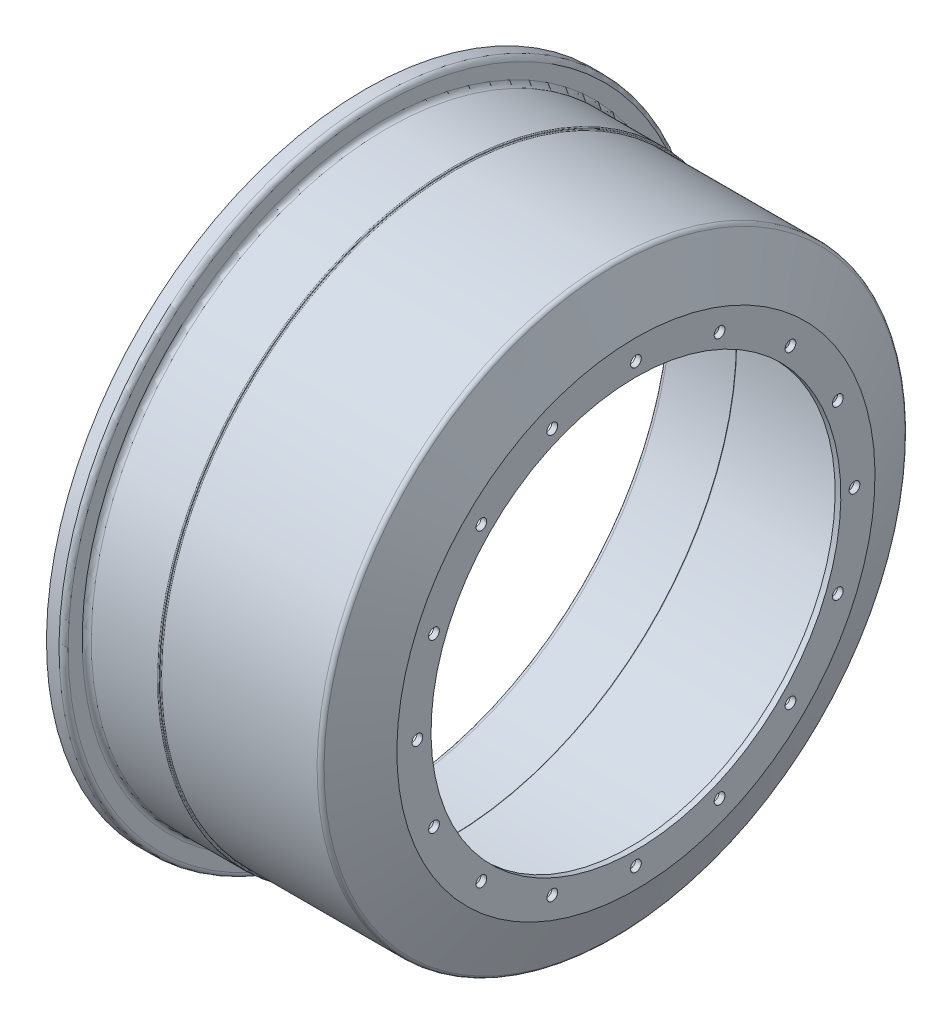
ISO-10303-21;
HEADER;
FILE_DESCRIPTION(('STEP AP214'),'2;1');
FILE_NAME('part.step','',(''),(''),'','','');
FILE_SCHEMA(('AUTOMOTIVE_DESIGN { 1 0 10303 214 1 1 1 1 }'));
ENDSEC;
DATA;
#1=APPLICATION_CONTEXT('core data for automotive mechanical design processes');
#2=APPLICATION_PROTOCOL_DEFINITION('international standard','automotive_design',2000,#1);
#3=PRODUCT_CONTEXT('',#1,'mechanical');
#4=PRODUCT('Part','Part','',(#3));
#5=PRODUCT_RELATED_PRODUCT_CATEGORY('part','',(#4));
#6=PRODUCT_DEFINITION_FORMATION('','',#4);
#7=PRODUCT_DEFINITION_CONTEXT('part definition',#1,'design');
#8=PRODUCT_DEFINITION('design','',#6,#7);
#9=PRODUCT_DEFINITION_SHAPE('','',#8);
#10=(LENGTH_UNIT() NAMED_UNIT(*) SI_UNIT(.MILLI.,.METRE.));
#11=(NAMED_UNIT(*) PLANE_ANGLE_UNIT() SI_UNIT($,.RADIAN.));
#12=(NAMED_UNIT(*) SI_UNIT($,.STERADIAN.) SOLID_ANGLE_UNIT());
#13=UNCERTAINTY_MEASURE_WITH_UNIT(LENGTH_MEASURE(1.E-05),#10,'distance_accuracy_value','');
#14=(GEOMETRIC_REPRESENTATION_CONTEXT(3) GLOBAL_UNCERTAINTY_ASSIGNED_CONTEXT((#13)) GLOBAL_UNIT_ASSIGNED_CONTEXT((#10,
#11,#12)) REPRESENTATION_CONTEXT('',''));
#15=CARTESIAN_POINT('',(0.,0.,0.));
#16=DIRECTION('',(0.,0.,1.));
#17=DIRECTION('',(1.,0.,0.));
#18=AXIS2_PLACEMENT_3D('',#15,#16,#17);
#19=CARTESIAN_POINT('',(0.,133.35,0.));
#20=DIRECTION('',(1.,0.,0.));
#21=DIRECTION('',(0.,1.,0.));
#22=AXIS2_PLACEMENT_3D('',#19,#20,#21);
#23=PLANE('',#22);
#24=CARTESIAN_POINT('',(0.,86.2104587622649,-86.2104587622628));
#25=DIRECTION('',(-1.,0.,0.));
#26=DIRECTION('',(0.,0.,1.));
#27=AXIS2_PLACEMENT_3D('',#24,#25,#26);
#28=CIRCLE('',#27,3.);
#29=CARTESIAN_POINT('',(0.,86.2104587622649,-83.2104587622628));
#30=VERTEX_POINT('',#29);
#31=EDGE_CURVE('E208',#30,#30,#28,.T.);
#32=ORIENTED_EDGE('',*,*,#31,.T.);
#33=EDGE_LOOP('',(#32));
#34=FACE_BOUND('',#33,.T.);
#35=CARTESIAN_POINT('',(0.,1.27704495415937E-12,-121.92));
#36=DIRECTION('',(-1.,0.,0.));
#37=DIRECTION('',(0.,0.,1.));
#38=AXIS2_PLACEMENT_3D('',#35,#36,#37);
#39=CIRCLE('',#38,3.);
#40=CARTESIAN_POINT('',(0.,1.27704495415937E-12,-118.92));
#41=VERTEX_POINT('',#40);
#42=EDGE_CURVE('E196',#41,#41,#39,.T.);
#43=ORIENTED_EDGE('',*,*,#42,.T.);
#44=EDGE_LOOP('',(#43));
#45=FACE_BOUND('',#44,.T.);
#46=CARTESIAN_POINT('',(0.,-86.2104587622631,-86.2104587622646));
#47=DIRECTION('',(-1.,0.,0.));
#48=DIRECTION('',(0.,0.,1.));
#49=AXIS2_PLACEMENT_3D('',#46,#47,#48);
#50=CIRCLE('',#49,3.);
#51=CARTESIAN_POINT('',(0.,-86.2104587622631,-83.2104587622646));
#52=VERTEX_POINT('',#51);
#53=EDGE_CURVE('E184',#52,#52,#50,.T.);
#54=ORIENTED_EDGE('',*,*,#53,.T.);
#55=EDGE_LOOP('',(#54));
#56=FACE_BOUND('',#55,.T.);
#57=CARTESIAN_POINT('',(0.,-121.92,-8.51363302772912E-13));
#58=DIRECTION('',(-1.,0.,0.));
#59=DIRECTION('',(0.,0.,1.));
#60=AXIS2_PLACEMENT_3D('',#57,#58,#59);
#61=CIRCLE('',#60,3.);
#62=CARTESIAN_POINT('',(0.,-121.92,2.99999999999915));
#63=VERTEX_POINT('',#62);
#64=EDGE_CURVE('E172',#63,#63,#61,.T.);
#65=ORIENTED_EDGE('',*,*,#64,.T.);
#66=EDGE_LOOP('',(#65));
#67=FACE_BOUND('',#66,.T.);
#68=CARTESIAN_POINT('',(0.,-86.2104587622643,86.2104587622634));
#69=DIRECTION('',(-1.,0.,0.));
#70=DIRECTION('',(0.,0.,1.));
#71=AXIS2_PLACEMENT_3D('',#68,#69,#70);
#72=CIRCLE('',#71,3.);
#73=CARTESIAN_POINT('',(0.,-86.2104587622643,89.2104587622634));
#74=VERTEX_POINT('',#73);
#75=EDGE_CURVE('E160',#74,#74,#72,.T.);
#76=ORIENTED_EDGE('',*,*,#75,.T.);
#77=EDGE_LOOP('',(#76));
#78=FACE_BOUND('',#77,.T.);
#79=CARTESIAN_POINT('',(0.,0.,0.));
#80=DIRECTION('',(1.,0.,0.));
#81=DIRECTION('',(0.,1.,0.));
#82=AXIS2_PLACEMENT_3D('',#79,#80,#81);
#83=CIRCLE('',#82,114.3);
#84=CARTESIAN_POINT('',(0.,114.3,0.));
#85=VERTEX_POINT('',#84);
#86=EDGE_CURVE('E42',#85,#85,#83,.T.);
#87=ORIENTED_EDGE('',*,*,#86,.F.);
#88=EDGE_LOOP('',(#87));
#89=FACE_BOUND('',#88,.T.);
#90=CARTESIAN_POINT('',(0.,0.,0.));
#91=DIRECTION('',(1.,0.,0.));
#92=DIRECTION('',(0.,1.,0.));
#93=AXIS2_PLACEMENT_3D('',#90,#91,#92);
#94=CIRCLE('',#93,133.35);
#95=CARTESIAN_POINT('',(0.,133.35,0.));
#96=VERTEX_POINT('',#95);
#97=EDGE_CURVE('E46',#96,#96,#94,.T.);
#98=ORIENTED_EDGE('',*,*,#97,.T.);
#99=EDGE_LOOP('',(#98));
#100=FACE_BOUND('',#99,.T.);
#101=CARTESIAN_POINT('',(0.,121.92,0.));
#102=DIRECTION('',(-1.,0.,0.));
#103=DIRECTION('',(0.,0.,1.));
#104=AXIS2_PLACEMENT_3D('',#101,#102,#103);
#105=CIRCLE('',#104,3.);
#106=CARTESIAN_POINT('',(0.,121.92,3.));
#107=VERTEX_POINT('',#106);
#108=EDGE_CURVE('E124',#107,#107,#105,.T.);
#109=ORIENTED_EDGE('',*,*,#108,.T.);
#110=EDGE_LOOP('',(#109));
#111=FACE_BOUND('',#110,.T.);
#112=CARTESIAN_POINT('',(0.,112.639392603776,46.6567640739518));
#113=DIRECTION('',(-1.,0.,0.));
#114=DIRECTION('',(0.,0.,1.));
#115=AXIS2_PLACEMENT_3D('',#112,#113,#114);
#116=CIRCLE('',#115,3.);
#117=CARTESIAN_POINT('',(0.,112.639392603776,49.6567640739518));
#118=VERTEX_POINT('',#117);
#119=EDGE_CURVE('E130',#118,#118,#116,.T.);
#120=ORIENTED_EDGE('',*,*,#119,.T.);
#121=EDGE_LOOP('',(#120));
#122=FACE_BOUND('',#121,.T.);
#123=CARTESIAN_POINT('',(0.,86.2104587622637,86.210458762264));
#124=DIRECTION('',(-1.,0.,0.));
#125=DIRECTION('',(0.,0.,1.));
#126=AXIS2_PLACEMENT_3D('',#123,#124,#125);
#127=CIRCLE('',#126,3.);
#128=CARTESIAN_POINT('',(0.,86.2104587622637,89.210458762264));
#129=VERTEX_POINT('',#128);
#130=EDGE_CURVE('E136',#129,#129,#127,.T.);
#131=ORIENTED_EDGE('',*,*,#130,.T.);
#132=EDGE_LOOP('',(#131));
#133=FACE_BOUND('',#132,.T.);
#134=CARTESIAN_POINT('',(0.,46.6567640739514,112.639392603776));
#135=DIRECTION('',(-1.,0.,0.));
#136=DIRECTION('',(0.,0.,1.));
#137=AXIS2_PLACEMENT_3D('',#134,#135,#136);
#138=CIRCLE('',#137,3.);
#139=CARTESIAN_POINT('',(0.,46.6567640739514,115.639392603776));
#140=VERTEX_POINT('',#139);
#141=EDGE_CURVE('E142',#140,#140,#138,.T.);
#142=ORIENTED_EDGE('',*,*,#141,.T.);
#143=EDGE_LOOP('',(#142));
#144=FACE_BOUND('',#143,.T.);
#145=CARTESIAN_POINT('',(0.,-4.25681651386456E-13,121.92));
#146=DIRECTION('',(-1.,0.,0.));
#147=DIRECTION('',(0.,0.,1.));
#148=AXIS2_PLACEMENT_3D('',#145,#146,#147);
#149=CIRCLE('',#148,3.);
#150=CARTESIAN_POINT('',(0.,-4.25681651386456E-13,124.92));
#151=VERTEX_POINT('',#150);
#152=EDGE_CURVE('E148',#151,#151,#149,.T.);
#153=ORIENTED_EDGE('',*,*,#152,.T.);
#154=EDGE_LOOP('',(#153));
#155=FACE_BOUND('',#154,.T.);
#156=CARTESIAN_POINT('',(0.,-46.6567640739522,112.639392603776));
#157=DIRECTION('',(-1.,0.,0.));
#158=DIRECTION('',(0.,0.,1.));
#159=AXIS2_PLACEMENT_3D('',#156,#157,#158);
#160=CIRCLE('',#159,3.);
#161=CARTESIAN_POINT('',(0.,-46.6567640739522,115.639392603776));
#162=VERTEX_POINT('',#161);
#163=EDGE_CURVE('E154',#162,#162,#160,.T.);
#164=ORIENTED_EDGE('',*,*,#163,.T.);
#165=EDGE_LOOP('',(#164));
#166=FACE_BOUND('',#165,.T.);
#167=CARTESIAN_POINT('',(0.,-112.639392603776,46.6567640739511));
#168=DIRECTION('',(-1.,0.,0.));
#169=DIRECTION('',(0.,0.,1.));
#170=AXIS2_PLACEMENT_3D('',#167,#168,#169);
#171=CIRCLE('',#170,3.);
#172=CARTESIAN_POINT('',(0.,-112.639392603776,49.6567640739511));
#173=VERTEX_POINT('',#172);
#174=EDGE_CURVE('E166',#173,#173,#171,.T.);
#175=ORIENTED_EDGE('',*,*,#174,.T.);
#176=EDGE_LOOP('',(#175));
#177=FACE_BOUND('',#176,.T.);
#178=CARTESIAN_POINT('',(0.,-112.639392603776,-46.6567640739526));
#179=DIRECTION('',(-1.,0.,0.));
#180=DIRECTION('',(0.,0.,1.));
#181=AXIS2_PLACEMENT_3D('',#178,#179,#180);
#182=CIRCLE('',#181,3.);
#183=CARTESIAN_POINT('',(0.,-112.639392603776,-43.6567640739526));
#184=VERTEX_POINT('',#183);
#185=EDGE_CURVE('E178',#184,#184,#182,.T.);
#186=ORIENTED_EDGE('',*,*,#185,.T.);
#187=EDGE_LOOP('',(#186));
#188=FACE_BOUND('',#187,.T.);
#189=CARTESIAN_POINT('',(0.,-46.6567640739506,-112.639392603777));
#190=DIRECTION('',(-1.,0.,0.));
#191=DIRECTION('',(0.,0.,1.));
#192=AXIS2_PLACEMENT_3D('',#189,#190,#191);
#193=CIRCLE('',#192,3.);
#194=CARTESIAN_POINT('',(0.,-46.6567640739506,-109.639392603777));
#195=VERTEX_POINT('',#194);
#196=EDGE_CURVE('E190',#195,#195,#193,.T.);
#197=ORIENTED_EDGE('',*,*,#196,.T.);
#198=EDGE_LOOP('',(#197));
#199=FACE_BOUND('',#198,.T.);
#200=CARTESIAN_POINT('',(0.,46.656764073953,-112.639392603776));
#201=DIRECTION('',(-1.,0.,0.));
#202=DIRECTION('',(0.,0.,1.));
#203=AXIS2_PLACEMENT_3D('',#200,#201,#202);
#204=CIRCLE('',#203,3.);
#205=CARTESIAN_POINT('',(0.,46.656764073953,-109.639392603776));
#206=VERTEX_POINT('',#205);
#207=EDGE_CURVE('E202',#206,#206,#204,.T.);
#208=ORIENTED_EDGE('',*,*,#207,.T.);
#209=EDGE_LOOP('',(#208));
#210=FACE_BOUND('',#209,.T.);
#211=CARTESIAN_POINT('',(0.,112.639392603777,-46.6567640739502));
#212=DIRECTION('',(-1.,0.,0.));
#213=DIRECTION('',(0.,0.,1.));
#214=AXIS2_PLACEMENT_3D('',#211,#212,#213);
#215=CIRCLE('',#214,3.);
#216=CARTESIAN_POINT('',(0.,112.639392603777,-43.6567640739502));
#217=VERTEX_POINT('',#216);
#218=EDGE_CURVE('E214',#217,#217,#215,.T.);
#219=ORIENTED_EDGE('',*,*,#218,.T.);
#220=EDGE_LOOP('',(#219));
#221=FACE_BOUND('',#220,.T.);
#222=ADVANCED_FACE('F35',(#34,#45,#56,#67,#78,#89,#100,#111,#122,#133,#144,#155,#166,#177,#188,
#199,#210,#221),#23,.T.);
#223=CARTESIAN_POINT('',(-3.17499999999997,130.175,0.));
#224=DIRECTION('',(-1.,0.,0.));
#225=DIRECTION('',(0.,-1.,0.));
#226=AXIS2_PLACEMENT_3D('',#223,#224,#225);
#227=PLANE('',#226);
#228=CARTESIAN_POINT('',(-3.17499999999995,112.639392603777,-46.6567640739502));
#229=DIRECTION('',(-1.,0.,0.));
#230=DIRECTION('',(0.,0.,1.));
#231=AXIS2_PLACEMENT_3D('',#228,#229,#230);
#232=CIRCLE('',#231,3.);
#233=CARTESIAN_POINT('',(-3.17499999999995,112.639392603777,-43.6567640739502));
#234=VERTEX_POINT('',#233);
#235=EDGE_CURVE('E211',#234,#234,#232,.T.);
#236=ORIENTED_EDGE('',*,*,#235,.F.);
#237=EDGE_LOOP('',(#236));
#238=FACE_BOUND('',#237,.T.);
#239=CARTESIAN_POINT('',(-3.17499999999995,86.2104587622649,-86.2104587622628));
#240=DIRECTION('',(-1.,0.,0.));
#241=DIRECTION('',(0.,0.,1.));
#242=AXIS2_PLACEMENT_3D('',#239,#240,#241);
#243=CIRCLE('',#242,3.);
#244=CARTESIAN_POINT('',(-3.17499999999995,86.2104587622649,-83.2104587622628));
#245=VERTEX_POINT('',#244);
#246=EDGE_CURVE('E205',#245,#245,#243,.T.);
#247=ORIENTED_EDGE('',*,*,#246,.F.);
#248=EDGE_LOOP('',(#247));
#249=FACE_BOUND('',#248,.T.);
#250=CARTESIAN_POINT('',(-3.17499999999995,46.656764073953,-112.639392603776));
#251=DIRECTION('',(-1.,0.,0.));
#252=DIRECTION('',(0.,0.,1.));
#253=AXIS2_PLACEMENT_3D('',#250,#251,#252);
#254=CIRCLE('',#253,3.);
#255=CARTESIAN_POINT('',(-3.17499999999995,46.656764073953,-109.639392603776));
#256=VERTEX_POINT('',#255);
#257=EDGE_CURVE('E199',#256,#256,#254,.T.);
#258=ORIENTED_EDGE('',*,*,#257,.F.);
#259=EDGE_LOOP('',(#258));
#260=FACE_BOUND('',#259,.T.);
#261=CARTESIAN_POINT('',(-3.17499999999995,1.27704495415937E-12,-121.92));
#262=DIRECTION('',(-1.,0.,0.));
#263=DIRECTION('',(0.,0.,1.));
#264=AXIS2_PLACEMENT_3D('',#261,#262,#263);
#265=CIRCLE('',#264,3.);
#266=CARTESIAN_POINT('',(-3.17499999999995,1.27704495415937E-12,-118.92));
#267=VERTEX_POINT('',#266);
#268=EDGE_CURVE('E193',#267,#267,#265,.T.);
#269=ORIENTED_EDGE('',*,*,#268,.F.);
#270=EDGE_LOOP('',(#269));
#271=FACE_BOUND('',#270,.T.);
#272=CARTESIAN_POINT('',(-3.17499999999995,-46.6567640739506,-112.639392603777));
#273=DIRECTION('',(-1.,0.,0.));
#274=DIRECTION('',(0.,0.,1.));
#275=AXIS2_PLACEMENT_3D('',#272,#273,#274);
#276=CIRCLE('',#275,3.);
#277=CARTESIAN_POINT('',(-3.17499999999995,-46.6567640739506,-109.639392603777));
#278=VERTEX_POINT('',#277);
#279=EDGE_CURVE('E187',#278,#278,#276,.T.);
#280=ORIENTED_EDGE('',*,*,#279,.F.);
#281=EDGE_LOOP('',(#280));
#282=FACE_BOUND('',#281,.T.);
#283=CARTESIAN_POINT('',(-3.17499999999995,-86.2104587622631,-86.2104587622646));
#284=DIRECTION('',(-1.,0.,0.));
#285=DIRECTION('',(0.,0.,1.));
#286=AXIS2_PLACEMENT_3D('',#283,#284,#285);
#287=CIRCLE('',#286,3.);
#288=CARTESIAN_POINT('',(-3.17499999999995,-86.2104587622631,-83.2104587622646));
#289=VERTEX_POINT('',#288);
#290=EDGE_CURVE('E181',#289,#289,#287,.T.);
#291=ORIENTED_EDGE('',*,*,#290,.F.);
#292=EDGE_LOOP('',(#291));
#293=FACE_BOUND('',#292,.T.);
#294=CARTESIAN_POINT('',(-3.17499999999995,-112.639392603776,-46.6567640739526));
#295=DIRECTION('',(-1.,0.,0.));
#296=DIRECTION('',(0.,0.,1.));
#297=AXIS2_PLACEMENT_3D('',#294,#295,#296);
#298=CIRCLE('',#297,3.);
#299=CARTESIAN_POINT('',(-3.17499999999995,-112.639392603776,-43.6567640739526));
#300=VERTEX_POINT('',#299);
#301=EDGE_CURVE('E175',#300,#300,#298,.T.);
#302=ORIENTED_EDGE('',*,*,#301,.F.);
#303=EDGE_LOOP('',(#302));
#304=FACE_BOUND('',#303,.T.);
#305=CARTESIAN_POINT('',(-3.17499999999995,-121.92,-8.51363302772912E-13));
#306=DIRECTION('',(-1.,0.,0.));
#307=DIRECTION('',(0.,0.,1.));
#308=AXIS2_PLACEMENT_3D('',#305,#306,#307);
#309=CIRCLE('',#308,3.);
#310=CARTESIAN_POINT('',(-3.17499999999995,-121.92,2.99999999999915));
#311=VERTEX_POINT('',#310);
#312=EDGE_CURVE('E169',#311,#311,#309,.T.);
#313=ORIENTED_EDGE('',*,*,#312,.F.);
#314=EDGE_LOOP('',(#313));
#315=FACE_BOUND('',#314,.T.);
#316=CARTESIAN_POINT('',(-3.17499999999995,-112.639392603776,46.6567640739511));
#317=DIRECTION('',(-1.,0.,0.));
#318=DIRECTION('',(0.,0.,1.));
#319=AXIS2_PLACEMENT_3D('',#316,#317,#318);
#320=CIRCLE('',#319,3.);
#321=CARTESIAN_POINT('',(-3.17499999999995,-112.639392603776,49.6567640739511));
#322=VERTEX_POINT('',#321);
#323=EDGE_CURVE('E163',#322,#322,#320,.T.);
#324=ORIENTED_EDGE('',*,*,#323,.F.);
#325=EDGE_LOOP('',(#324));
#326=FACE_BOUND('',#325,.T.);
#327=CARTESIAN_POINT('',(-3.17499999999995,-86.2104587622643,86.2104587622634));
#328=DIRECTION('',(-1.,0.,0.));
#329=DIRECTION('',(0.,0.,1.));
#330=AXIS2_PLACEMENT_3D('',#327,#328,#329);
#331=CIRCLE('',#330,3.);
#332=CARTESIAN_POINT('',(-3.17499999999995,-86.2104587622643,89.2104587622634));
#333=VERTEX_POINT('',#332);
#334=EDGE_CURVE('E157',#333,#333,#331,.T.);
#335=ORIENTED_EDGE('',*,*,#334,.F.);
#336=EDGE_LOOP('',(#335));
#337=FACE_BOUND('',#336,.T.);
#338=CARTESIAN_POINT('',(-3.17499999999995,-46.6567640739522,112.639392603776));
#339=DIRECTION('',(-1.,0.,0.));
#340=DIRECTION('',(0.,0.,1.));
#341=AXIS2_PLACEMENT_3D('',#338,#339,#340);
#342=CIRCLE('',#341,3.);
#343=CARTESIAN_POINT('',(-3.17499999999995,-46.6567640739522,115.639392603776));
#344=VERTEX_POINT('',#343);
#345=EDGE_CURVE('E151',#344,#344,#342,.T.);
#346=ORIENTED_EDGE('',*,*,#345,.F.);
#347=EDGE_LOOP('',(#346));
#348=FACE_BOUND('',#347,.T.);
#349=CARTESIAN_POINT('',(-3.17499999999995,-4.25681651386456E-13,121.92));
#350=DIRECTION('',(-1.,0.,0.));
#351=DIRECTION('',(0.,0.,1.));
#352=AXIS2_PLACEMENT_3D('',#349,#350,#351);
#353=CIRCLE('',#352,3.);
#354=CARTESIAN_POINT('',(-3.17499999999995,-4.25681651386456E-13,124.92));
#355=VERTEX_POINT('',#354);
#356=EDGE_CURVE('E145',#355,#355,#353,.T.);
#357=ORIENTED_EDGE('',*,*,#356,.F.);
#358=EDGE_LOOP('',(#357));
#359=FACE_BOUND('',#358,.T.);
#360=CARTESIAN_POINT('',(-3.17499999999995,46.6567640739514,112.639392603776));
#361=DIRECTION('',(-1.,0.,0.));
#362=DIRECTION('',(0.,0.,1.));
#363=AXIS2_PLACEMENT_3D('',#360,#361,#362);
#364=CIRCLE('',#363,3.);
#365=CARTESIAN_POINT('',(-3.17499999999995,46.6567640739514,115.639392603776));
#366=VERTEX_POINT('',#365);
#367=EDGE_CURVE('E139',#366,#366,#364,.T.);
#368=ORIENTED_EDGE('',*,*,#367,.F.);
#369=EDGE_LOOP('',(#368));
#370=FACE_BOUND('',#369,.T.);
#371=CARTESIAN_POINT('',(-3.17499999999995,86.2104587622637,86.210458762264));
#372=DIRECTION('',(-1.,0.,0.));
#373=DIRECTION('',(0.,0.,1.));
#374=AXIS2_PLACEMENT_3D('',#371,#372,#373);
#375=CIRCLE('',#374,3.);
#376=CARTESIAN_POINT('',(-3.17499999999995,86.2104587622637,89.210458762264));
#377=VERTEX_POINT('',#376);
#378=EDGE_CURVE('E133',#377,#377,#375,.T.);
#379=ORIENTED_EDGE('',*,*,#378,.F.);
#380=EDGE_LOOP('',(#379));
#381=FACE_BOUND('',#380,.T.);
#382=CARTESIAN_POINT('',(-3.17499999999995,112.639392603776,46.6567640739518));
#383=DIRECTION('',(-1.,0.,0.));
#384=DIRECTION('',(0.,0.,1.));
#385=AXIS2_PLACEMENT_3D('',#382,#383,#384);
#386=CIRCLE('',#385,3.);
#387=CARTESIAN_POINT('',(-3.17499999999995,112.639392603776,49.6567640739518));
#388=VERTEX_POINT('',#387);
#389=EDGE_CURVE('E127',#388,#388,#386,.T.);
#390=ORIENTED_EDGE('',*,*,#389,.F.);
#391=EDGE_LOOP('',(#390));
#392=FACE_BOUND('',#391,.T.);
#393=CARTESIAN_POINT('',(-3.17499999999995,121.92,0.));
#394=DIRECTION('',(-1.,0.,0.));
#395=DIRECTION('',(0.,0.,1.));
#396=AXIS2_PLACEMENT_3D('',#393,#394,#395);
#397=CIRCLE('',#396,3.);
#398=CARTESIAN_POINT('',(-3.17499999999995,121.92,3.));
#399=VERTEX_POINT('',#398);
#400=EDGE_CURVE('E121',#399,#399,#397,.T.);
#401=ORIENTED_EDGE('',*,*,#400,.F.);
#402=EDGE_LOOP('',(#401));
#403=FACE_BOUND('',#402,.T.);
#404=CARTESIAN_POINT('',(-3.17499999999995,0.,0.));
#405=DIRECTION('',(1.,0.,0.));
#406=DIRECTION('',(0.,1.,0.));
#407=AXIS2_PLACEMENT_3D('',#404,#405,#406);
#408=CIRCLE('',#407,114.3);
#409=CARTESIAN_POINT('',(-3.17499999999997,114.3,0.));
#410=VERTEX_POINT('',#409);
#411=EDGE_CURVE('E10',#410,#410,#408,.T.);
#412=ORIENTED_EDGE('',*,*,#411,.T.);
#413=EDGE_LOOP('',(#412));
#414=FACE_BOUND('',#413,.T.);
#415=CARTESIAN_POINT('',(-3.17499999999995,0.,0.));
#416=DIRECTION('',(1.,0.,0.));
#417=DIRECTION('',(0.,1.,0.));
#418=AXIS2_PLACEMENT_3D('',#415,#416,#417);
#419=CIRCLE('',#418,130.175);
#420=CARTESIAN_POINT('',(-3.17499999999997,130.175,0.));
#421=VERTEX_POINT('',#420);
#422=EDGE_CURVE('E118',#421,#421,#419,.T.);
#423=ORIENTED_EDGE('',*,*,#422,.F.);
#424=EDGE_LOOP('',(#423));
#425=FACE_BOUND('',#424,.T.);
#426=ADVANCED_FACE('F37',(#238,#249,#260,#271,#282,#293,#304,#315,#326,#337,#348,#359,#370,#381,
#392,#403,#414,#425),#227,.T.);
#427=CARTESIAN_POINT('',(0.,0.,0.));
#428=DIRECTION('',(1.,0.,0.));
#429=DIRECTION('',(0.,1.,0.));
#430=AXIS2_PLACEMENT_3D('',#427,#428,#429);
#431=CYLINDRICAL_SURFACE('',#430,114.3);
#432=ORIENTED_EDGE('',*,*,#86,.T.);
#433=EDGE_LOOP('',(#432));
#434=FACE_BOUND('',#433,.T.);
#435=ORIENTED_EDGE('',*,*,#411,.F.);
#436=EDGE_LOOP('',(#435));
#437=FACE_BOUND('',#436,.T.);
#438=ADVANCED_FACE('F228',(#434,#437),#431,.F.);
#439=CARTESIAN_POINT('',(0.,0.,0.));
#440=DIRECTION('',(-1.,0.,0.));
#441=DIRECTION('',(0.,-1.,0.));
#442=AXIS2_PLACEMENT_3D('',#439,#440,#441);
#443=CONICAL_SURFACE('',#442,133.35,1.17689982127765);
#444=CARTESIAN_POINT('',(-11.9224865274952,0.,0.));
#445=DIRECTION('',(1.,0.,0.));
#446=DIRECTION('',(0.,1.,0.));
#447=AXIS2_PLACEMENT_3D('',#444,#445,#446);
#448=CIRCLE('',#447,162.036225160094);
#449=CARTESIAN_POINT('',(-11.9224865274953,162.036225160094,0.));
#450=VERTEX_POINT('',#449);
#451=EDGE_CURVE('E50',#450,#450,#448,.T.);
#452=ORIENTED_EDGE('',*,*,#451,.T.);
#453=EDGE_LOOP('',(#452));
#454=FACE_BOUND('',#453,.T.);
#455=ORIENTED_EDGE('',*,*,#97,.F.);
#456=EDGE_LOOP('',(#455));
#457=FACE_BOUND('',#456,.T.);
#458=ADVANCED_FACE('F391',(#454,#457),#443,.T.);
#459=CARTESIAN_POINT('',(-14.2679749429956,0.,0.));
#460=DIRECTION('',(1.,0.,0.));
#461=DIRECTION('',(0.,1.,0.));
#462=AXIS2_PLACEMENT_3D('',#459,#460,#461);
#463=TOROIDAL_SURFACE('',#462,161.0614,2.53999999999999);
#464=CARTESIAN_POINT('',(-14.2679749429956,0.,0.));
#465=DIRECTION('',(1.,0.,0.));
#466=DIRECTION('',(0.,1.,0.));
#467=AXIS2_PLACEMENT_3D('',#464,#465,#466);
#468=CIRCLE('',#467,163.6014);
#469=CARTESIAN_POINT('',(-14.2679749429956,163.6014,0.));
#470=VERTEX_POINT('',#469);
#471=EDGE_CURVE('E55',#470,#470,#468,.T.);
#472=ORIENTED_EDGE('',*,*,#471,.T.);
#473=EDGE_LOOP('',(#472));
#474=FACE_BOUND('',#473,.T.);
#475=ORIENTED_EDGE('',*,*,#451,.F.);
#476=EDGE_LOOP('',(#475));
#477=FACE_BOUND('',#476,.T.);
#478=ADVANCED_FACE('F385',(#474,#477),#463,.T.);
#479=CARTESIAN_POINT('',(0.,0.,0.));
#480=DIRECTION('',(1.,0.,0.));
#481=DIRECTION('',(0.,1.,0.));
#482=AXIS2_PLACEMENT_3D('',#479,#480,#481);
#483=CYLINDRICAL_SURFACE('',#482,163.6014);
#484=CARTESIAN_POINT('',(-100.965,0.,0.));
#485=DIRECTION('',(1.,0.,0.));
#486=DIRECTION('',(0.,1.,0.));
#487=AXIS2_PLACEMENT_3D('',#484,#485,#486);
#488=CIRCLE('',#487,163.6014);
#489=CARTESIAN_POINT('',(-100.965,163.6014,0.));
#490=VERTEX_POINT('',#489);
#491=EDGE_CURVE('E58',#490,#490,#488,.T.);
#492=ORIENTED_EDGE('',*,*,#491,.T.);
#493=EDGE_LOOP('',(#492));
#494=FACE_BOUND('',#493,.T.);
#495=ORIENTED_EDGE('',*,*,#471,.F.);
#496=EDGE_LOOP('',(#495));
#497=FACE_BOUND('',#496,.T.);
#498=ADVANCED_FACE('F379',(#494,#497),#483,.T.);
#499=CARTESIAN_POINT('',(-100.965,0.,0.));
#500=DIRECTION('',(1.,0.,0.));
#501=DIRECTION('',(0.,1.,0.));
#502=AXIS2_PLACEMENT_3D('',#499,#500,#501);
#503=TOROIDAL_SURFACE('',#502,164.1094,0.508000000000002);
#504=CARTESIAN_POINT('',(-101.473,0.,0.));
#505=DIRECTION('',(1.,0.,0.));
#506=DIRECTION('',(0.,1.,0.));
#507=AXIS2_PLACEMENT_3D('',#504,#505,#506);
#508=CIRCLE('',#507,164.1094);
#509=CARTESIAN_POINT('',(-101.473,164.1094,0.));
#510=VERTEX_POINT('',#509);
#511=EDGE_CURVE('E61',#510,#510,#508,.T.);
#512=ORIENTED_EDGE('',*,*,#511,.T.);
#513=EDGE_LOOP('',(#512));
#514=FACE_BOUND('',#513,.T.);
#515=ORIENTED_EDGE('',*,*,#491,.F.);
#516=EDGE_LOOP('',(#515));
#517=FACE_BOUND('',#516,.T.);
#518=ADVANCED_FACE('F373',(#514,#517),#503,.F.);
#519=CARTESIAN_POINT('',(-101.473,164.3634,0.));
#520=DIRECTION('',(1.,0.,0.));
#521=DIRECTION('',(0.,1.,0.));
#522=AXIS2_PLACEMENT_3D('',#519,#520,#521);
#523=PLANE('',#522);
#524=CARTESIAN_POINT('',(-101.473,0.,0.));
#525=DIRECTION('',(1.,0.,0.));
#526=DIRECTION('',(0.,1.,0.));
#527=AXIS2_PLACEMENT_3D('',#524,#525,#526);
#528=CIRCLE('',#527,164.3634);
#529=CARTESIAN_POINT('',(-101.473,164.3634,0.));
#530=VERTEX_POINT('',#529);
#531=EDGE_CURVE('E64',#530,#530,#528,.T.);
#532=ORIENTED_EDGE('',*,*,#531,.T.);
#533=EDGE_LOOP('',(#532));
#534=FACE_BOUND('',#533,.T.);
#535=ORIENTED_EDGE('',*,*,#511,.F.);
#536=EDGE_LOOP('',(#535));
#537=FACE_BOUND('',#536,.T.);
#538=ADVANCED_FACE('F367',(#534,#537),#523,.T.);
#539=CARTESIAN_POINT('',(-101.981,0.,0.));
#540=DIRECTION('',(1.,0.,0.));
#541=DIRECTION('',(0.,1.,0.));
#542=AXIS2_PLACEMENT_3D('',#539,#540,#541);
#543=TOROIDAL_SURFACE('',#542,164.3634,0.507999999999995);
#544=CARTESIAN_POINT('',(-101.981,0.,0.));
#545=DIRECTION('',(1.,0.,0.));
#546=DIRECTION('',(0.,1.,0.));
#547=AXIS2_PLACEMENT_3D('',#544,#545,#546);
#548=CIRCLE('',#547,164.8714);
#549=CARTESIAN_POINT('',(-101.981,164.8714,0.));
#550=VERTEX_POINT('',#549);
#551=EDGE_CURVE('E67',#550,#550,#548,.T.);
#552=ORIENTED_EDGE('',*,*,#551,.T.);
#553=EDGE_LOOP('',(#552));
#554=FACE_BOUND('',#553,.T.);
#555=ORIENTED_EDGE('',*,*,#531,.F.);
#556=EDGE_LOOP('',(#555));
#557=FACE_BOUND('',#556,.T.);
#558=ADVANCED_FACE('F361',(#554,#557),#543,.T.);
#559=CARTESIAN_POINT('',(0.,0.,0.));
#560=DIRECTION('',(1.,0.,0.));
#561=DIRECTION('',(0.,1.,0.));
#562=AXIS2_PLACEMENT_3D('',#559,#560,#561);
#563=CYLINDRICAL_SURFACE('',#562,164.8714);
#564=CARTESIAN_POINT('',(-138.938,0.,0.));
#565=DIRECTION('',(1.,0.,0.));
#566=DIRECTION('',(0.,1.,0.));
#567=AXIS2_PLACEMENT_3D('',#564,#565,#566);
#568=CIRCLE('',#567,164.8714);
#569=CARTESIAN_POINT('',(-138.938,164.8714,0.));
#570=VERTEX_POINT('',#569);
#571=EDGE_CURVE('E70',#570,#570,#568,.T.);
#572=ORIENTED_EDGE('',*,*,#571,.T.);
#573=EDGE_LOOP('',(#572));
#574=FACE_BOUND('',#573,.T.);
#575=ORIENTED_EDGE('',*,*,#551,.F.);
#576=EDGE_LOOP('',(#575));
#577=FACE_BOUND('',#576,.T.);
#578=ADVANCED_FACE('F355',(#574,#577),#563,.T.);
#579=CARTESIAN_POINT('',(-138.938,0.,0.));
#580=DIRECTION('',(1.,0.,0.));
#581=DIRECTION('',(0.,1.,0.));
#582=AXIS2_PLACEMENT_3D('',#579,#580,#581);
#583=TOROIDAL_SURFACE('',#582,167.4114,2.54);
#584=CARTESIAN_POINT('',(-141.478,0.,0.));
#585=DIRECTION('',(1.,0.,0.));
#586=DIRECTION('',(0.,1.,0.));
#587=AXIS2_PLACEMENT_3D('',#584,#585,#586);
#588=CIRCLE('',#587,167.4114);
#589=CARTESIAN_POINT('',(-141.478,167.4114,0.));
#590=VERTEX_POINT('',#589);
#591=EDGE_CURVE('E73',#590,#590,#588,.T.);
#592=ORIENTED_EDGE('',*,*,#591,.T.);
#593=EDGE_LOOP('',(#592));
#594=FACE_BOUND('',#593,.T.);
#595=ORIENTED_EDGE('',*,*,#571,.F.);
#596=EDGE_LOOP('',(#595));
#597=FACE_BOUND('',#596,.T.);
#598=ADVANCED_FACE('F349',(#594,#597),#583,.F.);
#599=CARTESIAN_POINT('',(-141.478,167.4114,0.));
#600=DIRECTION('',(1.,0.,0.));
#601=DIRECTION('',(0.,1.,0.));
#602=AXIS2_PLACEMENT_3D('',#599,#600,#601);
#603=PLANE('',#602);
#604=CARTESIAN_POINT('',(-141.478,0.,0.));
#605=DIRECTION('',(1.,0.,0.));
#606=DIRECTION('',(0.,1.,0.));
#607=AXIS2_PLACEMENT_3D('',#604,#605,#606);
#608=CIRCLE('',#607,175.26);
#609=CARTESIAN_POINT('',(-141.478,175.26,0.));
#610=VERTEX_POINT('',#609);
#611=EDGE_CURVE('E76',#610,#610,#608,.T.);
#612=ORIENTED_EDGE('',*,*,#611,.T.);
#613=EDGE_LOOP('',(#612));
#614=FACE_BOUND('',#613,.T.);
#615=ORIENTED_EDGE('',*,*,#591,.F.);
#616=EDGE_LOOP('',(#615));
#617=FACE_BOUND('',#616,.T.);
#618=ADVANCED_FACE('F343',(#614,#617),#603,.T.);
#619=CARTESIAN_POINT('',(-144.018,0.,0.));
#620=DIRECTION('',(1.,0.,0.));
#621=DIRECTION('',(0.,1.,0.));
#622=AXIS2_PLACEMENT_3D('',#619,#620,#621);
#623=TOROIDAL_SURFACE('',#622,175.26,2.53999999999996);
#624=CARTESIAN_POINT('',(-144.018,0.,0.));
#625=DIRECTION('',(1.,0.,0.));
#626=DIRECTION('',(0.,1.,0.));
#627=AXIS2_PLACEMENT_3D('',#624,#625,#626);
#628=CIRCLE('',#627,177.8);
#629=CARTESIAN_POINT('',(-144.018,177.8,0.));
#630=VERTEX_POINT('',#629);
#631=EDGE_CURVE('E79',#630,#630,#628,.T.);
#632=ORIENTED_EDGE('',*,*,#631,.T.);
#633=EDGE_LOOP('',(#632));
#634=FACE_BOUND('',#633,.T.);
#635=ORIENTED_EDGE('',*,*,#611,.F.);
#636=EDGE_LOOP('',(#635));
#637=FACE_BOUND('',#636,.T.);
#638=ADVANCED_FACE('F337',(#634,#637),#623,.T.);
#639=CARTESIAN_POINT('',(0.,0.,0.));
#640=DIRECTION('',(1.,0.,0.));
#641=DIRECTION('',(0.,1.,0.));
#642=AXIS2_PLACEMENT_3D('',#639,#640,#641);
#643=CYLINDRICAL_SURFACE('',#642,177.8);
#644=CARTESIAN_POINT('',(-151.003,0.,0.));
#645=DIRECTION('',(1.,0.,0.));
#646=DIRECTION('',(0.,1.,0.));
#647=AXIS2_PLACEMENT_3D('',#644,#645,#646);
#648=CIRCLE('',#647,177.8);
#649=CARTESIAN_POINT('',(-151.003,177.8,0.));
#650=VERTEX_POINT('',#649);
#651=EDGE_CURVE('E82',#650,#650,#648,.T.);
#652=ORIENTED_EDGE('',*,*,#651,.T.);
#653=EDGE_LOOP('',(#652));
#654=FACE_BOUND('',#653,.T.);
#655=ORIENTED_EDGE('',*,*,#631,.F.);
#656=EDGE_LOOP('',(#655));
#657=FACE_BOUND('',#656,.T.);
#658=ADVANCED_FACE('F331',(#654,#657),#643,.T.);
#659=CARTESIAN_POINT('',(-151.003,177.8,0.));
#660=DIRECTION('',(-1.,0.,0.));
#661=DIRECTION('',(0.,-1.,0.));
#662=AXIS2_PLACEMENT_3D('',#659,#660,#661);
#663=PLANE('',#662);
#664=CARTESIAN_POINT('',(-151.003,0.,0.));
#665=DIRECTION('',(1.,0.,0.));
#666=DIRECTION('',(0.,1.,0.));
#667=AXIS2_PLACEMENT_3D('',#664,#665,#666);
#668=CIRCLE('',#667,174.625);
#669=CARTESIAN_POINT('',(-151.003,174.625,0.));
#670=VERTEX_POINT('',#669);
#671=EDGE_CURVE('E85',#670,#670,#668,.T.);
#672=ORIENTED_EDGE('',*,*,#671,.T.);
#673=EDGE_LOOP('',(#672));
#674=FACE_BOUND('',#673,.T.);
#675=ORIENTED_EDGE('',*,*,#651,.F.);
#676=EDGE_LOOP('',(#675));
#677=FACE_BOUND('',#676,.T.);
#678=ADVANCED_FACE('F325',(#674,#677),#663,.T.);
#679=CARTESIAN_POINT('',(0.,0.,0.));
#680=DIRECTION('',(1.,0.,0.));
#681=DIRECTION('',(0.,1.,0.));
#682=AXIS2_PLACEMENT_3D('',#679,#680,#681);
#683=CYLINDRICAL_SURFACE('',#682,174.625);
#684=CARTESIAN_POINT('',(-147.193,0.,0.));
#685=DIRECTION('',(1.,0.,0.));
#686=DIRECTION('',(0.,1.,0.));
#687=AXIS2_PLACEMENT_3D('',#684,#685,#686);
#688=CIRCLE('',#687,174.625);
#689=CARTESIAN_POINT('',(-147.193,174.625,0.));
#690=VERTEX_POINT('',#689);
#691=EDGE_CURVE('E88',#690,#690,#688,.T.);
#692=ORIENTED_EDGE('',*,*,#691,.T.);
#693=EDGE_LOOP('',(#692));
#694=FACE_BOUND('',#693,.T.);
#695=ORIENTED_EDGE('',*,*,#671,.F.);
#696=EDGE_LOOP('',(#695));
#697=FACE_BOUND('',#696,.T.);
#698=ADVANCED_FACE('F319',(#694,#697),#683,.F.);
#699=CARTESIAN_POINT('',(-147.193,0.,0.));
#700=DIRECTION('',(1.,0.,0.));
#701=DIRECTION('',(0.,1.,0.));
#702=AXIS2_PLACEMENT_3D('',#699,#700,#701);
#703=TOROIDAL_SURFACE('',#702,172.085,2.53999999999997);
#704=CARTESIAN_POINT('',(-144.653,0.,0.));
#705=DIRECTION('',(1.,0.,0.));
#706=DIRECTION('',(0.,1.,0.));
#707=AXIS2_PLACEMENT_3D('',#704,#705,#706);
#708=CIRCLE('',#707,172.085);
#709=CARTESIAN_POINT('',(-144.653,172.085,0.));
#710=VERTEX_POINT('',#709);
#711=EDGE_CURVE('E91',#710,#710,#708,.T.);
#712=ORIENTED_EDGE('',*,*,#711,.T.);
#713=EDGE_LOOP('',(#712));
#714=FACE_BOUND('',#713,.T.);
#715=ORIENTED_EDGE('',*,*,#691,.F.);
#716=EDGE_LOOP('',(#715));
#717=FACE_BOUND('',#716,.T.);
#718=ADVANCED_FACE('F313',(#714,#717),#703,.F.);
#719=CARTESIAN_POINT('',(-144.653,164.2364,0.));
#720=DIRECTION('',(-1.,0.,0.));
#721=DIRECTION('',(0.,-1.,0.));
#722=AXIS2_PLACEMENT_3D('',#719,#720,#721);
#723=PLANE('',#722);
#724=CARTESIAN_POINT('',(-144.653,0.,0.));
#725=DIRECTION('',(1.,0.,0.));
#726=DIRECTION('',(0.,1.,0.));
#727=AXIS2_PLACEMENT_3D('',#724,#725,#726);
#728=CIRCLE('',#727,164.2364);
#729=CARTESIAN_POINT('',(-144.653,164.2364,0.));
#730=VERTEX_POINT('',#729);
#731=EDGE_CURVE('E94',#730,#730,#728,.T.);
#732=ORIENTED_EDGE('',*,*,#731,.T.);
#733=EDGE_LOOP('',(#732));
#734=FACE_BOUND('',#733,.T.);
#735=ORIENTED_EDGE('',*,*,#711,.F.);
#736=EDGE_LOOP('',(#735));
#737=FACE_BOUND('',#736,.T.);
#738=ADVANCED_FACE('F307',(#734,#737),#723,.T.);
#739=CARTESIAN_POINT('',(-142.113,0.,0.));
#740=DIRECTION('',(1.,0.,0.));
#741=DIRECTION('',(0.,1.,0.));
#742=AXIS2_PLACEMENT_3D('',#739,#740,#741);
#743=TOROIDAL_SURFACE('',#742,164.2364,2.53999999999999);
#744=CARTESIAN_POINT('',(-142.113,0.,0.));
#745=DIRECTION('',(1.,0.,0.));
#746=DIRECTION('',(0.,1.,0.));
#747=AXIS2_PLACEMENT_3D('',#744,#745,#746);
#748=CIRCLE('',#747,161.6964);
#749=CARTESIAN_POINT('',(-142.113,161.6964,0.));
#750=VERTEX_POINT('',#749);
#751=EDGE_CURVE('E97',#750,#750,#748,.T.);
#752=ORIENTED_EDGE('',*,*,#751,.T.);
#753=EDGE_LOOP('',(#752));
#754=FACE_BOUND('',#753,.T.);
#755=ORIENTED_EDGE('',*,*,#731,.F.);
#756=EDGE_LOOP('',(#755));
#757=FACE_BOUND('',#756,.T.);
#758=ADVANCED_FACE('F301',(#754,#757),#743,.T.);
#759=CARTESIAN_POINT('',(0.,0.,0.));
#760=DIRECTION('',(1.,0.,0.));
#761=DIRECTION('',(0.,1.,0.));
#762=AXIS2_PLACEMENT_3D('',#759,#760,#761);
#763=CYLINDRICAL_SURFACE('',#762,161.6964);
#764=CARTESIAN_POINT('',(-105.156,0.,0.));
#765=DIRECTION('',(1.,0.,0.));
#766=DIRECTION('',(0.,1.,0.));
#767=AXIS2_PLACEMENT_3D('',#764,#765,#766);
#768=CIRCLE('',#767,161.6964);
#769=CARTESIAN_POINT('',(-105.156,161.6964,0.));
#770=VERTEX_POINT('',#769);
#771=EDGE_CURVE('E100',#770,#770,#768,.T.);
#772=ORIENTED_EDGE('',*,*,#771,.T.);
#773=EDGE_LOOP('',(#772));
#774=FACE_BOUND('',#773,.T.);
#775=ORIENTED_EDGE('',*,*,#751,.F.);
#776=EDGE_LOOP('',(#775));
#777=FACE_BOUND('',#776,.T.);
#778=ADVANCED_FACE('F295',(#774,#777),#763,.F.);
#779=CARTESIAN_POINT('',(-105.156,0.,0.));
#780=DIRECTION('',(1.,0.,0.));
#781=DIRECTION('',(0.,1.,0.));
#782=AXIS2_PLACEMENT_3D('',#779,#780,#781);
#783=TOROIDAL_SURFACE('',#782,161.1884,0.508000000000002);
#784=CARTESIAN_POINT('',(-104.648,0.,0.));
#785=DIRECTION('',(1.,0.,0.));
#786=DIRECTION('',(0.,1.,0.));
#787=AXIS2_PLACEMENT_3D('',#784,#785,#786);
#788=CIRCLE('',#787,161.1884);
#789=CARTESIAN_POINT('',(-104.648,161.1884,0.));
#790=VERTEX_POINT('',#789);
#791=EDGE_CURVE('E103',#790,#790,#788,.T.);
#792=ORIENTED_EDGE('',*,*,#791,.T.);
#793=EDGE_LOOP('',(#792));
#794=FACE_BOUND('',#793,.T.);
#795=ORIENTED_EDGE('',*,*,#771,.F.);
#796=EDGE_LOOP('',(#795));
#797=FACE_BOUND('',#796,.T.);
#798=ADVANCED_FACE('F289',(#794,#797),#783,.F.);
#799=CARTESIAN_POINT('',(-104.648,161.1884,0.));
#800=DIRECTION('',(-1.,0.,0.));
#801=DIRECTION('',(0.,-1.,0.));
#802=AXIS2_PLACEMENT_3D('',#799,#800,#801);
#803=PLANE('',#802);
#804=CARTESIAN_POINT('',(-104.648,0.,0.));
#805=DIRECTION('',(1.,0.,0.));
#806=DIRECTION('',(0.,1.,0.));
#807=AXIS2_PLACEMENT_3D('',#804,#805,#806);
#808=CIRCLE('',#807,160.9344);
#809=CARTESIAN_POINT('',(-104.648,160.9344,0.));
#810=VERTEX_POINT('',#809);
#811=EDGE_CURVE('E106',#810,#810,#808,.T.);
#812=ORIENTED_EDGE('',*,*,#811,.T.);
#813=EDGE_LOOP('',(#812));
#814=FACE_BOUND('',#813,.T.);
#815=ORIENTED_EDGE('',*,*,#791,.F.);
#816=EDGE_LOOP('',(#815));
#817=FACE_BOUND('',#816,.T.);
#818=ADVANCED_FACE('F283',(#814,#817),#803,.T.);
#819=CARTESIAN_POINT('',(-104.14,0.,0.));
#820=DIRECTION('',(1.,0.,0.));
#821=DIRECTION('',(0.,1.,0.));
#822=AXIS2_PLACEMENT_3D('',#819,#820,#821);
#823=TOROIDAL_SURFACE('',#822,160.9344,0.508000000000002);
#824=CARTESIAN_POINT('',(-104.14,0.,0.));
#825=DIRECTION('',(1.,0.,0.));
#826=DIRECTION('',(0.,1.,0.));
#827=AXIS2_PLACEMENT_3D('',#824,#825,#826);
#828=CIRCLE('',#827,160.4264);
#829=CARTESIAN_POINT('',(-104.14,160.4264,0.));
#830=VERTEX_POINT('',#829);
#831=EDGE_CURVE('E109',#830,#830,#828,.T.);
#832=ORIENTED_EDGE('',*,*,#831,.T.);
#833=EDGE_LOOP('',(#832));
#834=FACE_BOUND('',#833,.T.);
#835=ORIENTED_EDGE('',*,*,#811,.F.);
#836=EDGE_LOOP('',(#835));
#837=FACE_BOUND('',#836,.T.);
#838=ADVANCED_FACE('F277',(#834,#837),#823,.T.);
#839=CARTESIAN_POINT('',(0.,0.,0.));
#840=DIRECTION('',(1.,0.,0.));
#841=DIRECTION('',(0.,1.,0.));
#842=AXIS2_PLACEMENT_3D('',#839,#840,#841);
#843=CYLINDRICAL_SURFACE('',#842,160.4264);
#844=CARTESIAN_POINT('',(-17.4429749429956,0.,0.));
#845=DIRECTION('',(1.,0.,0.));
#846=DIRECTION('',(0.,1.,0.));
#847=AXIS2_PLACEMENT_3D('',#844,#845,#846);
#848=CIRCLE('',#847,160.4264);
#849=CARTESIAN_POINT('',(-17.4429749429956,160.4264,0.));
#850=VERTEX_POINT('',#849);
#851=EDGE_CURVE('E112',#850,#850,#848,.T.);
#852=ORIENTED_EDGE('',*,*,#851,.T.);
#853=EDGE_LOOP('',(#852));
#854=FACE_BOUND('',#853,.T.);
#855=ORIENTED_EDGE('',*,*,#831,.F.);
#856=EDGE_LOOP('',(#855));
#857=FACE_BOUND('',#856,.T.);
#858=ADVANCED_FACE('F271',(#854,#857),#843,.F.);
#859=CARTESIAN_POINT('',(-17.4429749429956,0.,0.));
#860=DIRECTION('',(1.,0.,0.));
#861=DIRECTION('',(0.,1.,0.));
#862=AXIS2_PLACEMENT_3D('',#859,#860,#861);
#863=TOROIDAL_SURFACE('',#862,157.8864,2.54);
#864=CARTESIAN_POINT('',(-15.0974865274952,0.,0.));
#865=DIRECTION('',(1.,0.,0.));
#866=DIRECTION('',(0.,1.,0.));
#867=AXIS2_PLACEMENT_3D('',#864,#865,#866);
#868=CIRCLE('',#867,158.861225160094);
#869=CARTESIAN_POINT('',(-15.0974865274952,158.861225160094,0.));
#870=VERTEX_POINT('',#869);
#871=EDGE_CURVE('E115',#870,#870,#868,.T.);
#872=ORIENTED_EDGE('',*,*,#871,.T.);
#873=EDGE_LOOP('',(#872));
#874=FACE_BOUND('',#873,.T.);
#875=ORIENTED_EDGE('',*,*,#851,.F.);
#876=EDGE_LOOP('',(#875));
#877=FACE_BOUND('',#876,.T.);
#878=ADVANCED_FACE('F265',(#874,#877),#863,.F.);
#879=CARTESIAN_POINT('',(-15.0974865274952,0.,0.));
#880=DIRECTION('',(-1.,0.,0.));
#881=DIRECTION('',(0.,-1.,0.));
#882=AXIS2_PLACEMENT_3D('',#879,#880,#881);
#883=CONICAL_SURFACE('',#882,158.861225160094,1.17689982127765);
#884=ORIENTED_EDGE('',*,*,#422,.T.);
#885=EDGE_LOOP('',(#884));
#886=FACE_BOUND('',#885,.T.);
#887=ORIENTED_EDGE('',*,*,#871,.F.);
#888=EDGE_LOOP('',(#887));
#889=FACE_BOUND('',#888,.T.);
#890=ADVANCED_FACE('F261',(#886,#889),#883,.F.);
#891=CARTESIAN_POINT('',(-3.17499999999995,121.92,0.));
#892=DIRECTION('',(-1.,0.,0.));
#893=DIRECTION('',(0.,0.,1.));
#894=AXIS2_PLACEMENT_3D('',#891,#892,#893);
#895=CYLINDRICAL_SURFACE('',#894,3.);
#896=ORIENTED_EDGE('',*,*,#108,.F.);
#897=EDGE_LOOP('',(#896));
#898=FACE_BOUND('',#897,.T.);
#899=ORIENTED_EDGE('',*,*,#400,.T.);
#900=EDGE_LOOP('',(#899));
#901=FACE_BOUND('',#900,.T.);
#902=ADVANCED_FACE('F264',(#898,#901),#895,.F.);
#903=CARTESIAN_POINT('',(-3.17499999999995,112.639392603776,46.6567640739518));
#904=DIRECTION('',(-1.,0.,0.));
#905=DIRECTION('',(0.,0.,1.));
#906=AXIS2_PLACEMENT_3D('',#903,#904,#905);
#907=CYLINDRICAL_SURFACE('',#906,3.);
#908=ORIENTED_EDGE('',*,*,#119,.F.);
#909=EDGE_LOOP('',(#908));
#910=FACE_BOUND('',#909,.T.);
#911=ORIENTED_EDGE('',*,*,#389,.T.);
#912=EDGE_LOOP('',(#911));
#913=FACE_BOUND('',#912,.T.);
#914=ADVANCED_FACE('F477',(#910,#913),#907,.F.);
#915=CARTESIAN_POINT('',(-3.17499999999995,86.2104587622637,86.210458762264));
#916=DIRECTION('',(-1.,0.,0.));
#917=DIRECTION('',(0.,0.,1.));
#918=AXIS2_PLACEMENT_3D('',#915,#916,#917);
#919=CYLINDRICAL_SURFACE('',#918,3.);
#920=ORIENTED_EDGE('',*,*,#130,.F.);
#921=EDGE_LOOP('',(#920));
#922=FACE_BOUND('',#921,.T.);
#923=ORIENTED_EDGE('',*,*,#378,.T.);
#924=EDGE_LOOP('',(#923));
#925=FACE_BOUND('',#924,.T.);
#926=ADVANCED_FACE('F473',(#922,#925),#919,.F.);
#927=CARTESIAN_POINT('',(-3.17499999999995,46.6567640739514,112.639392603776));
#928=DIRECTION('',(-1.,0.,0.));
#929=DIRECTION('',(0.,0.,1.));
#930=AXIS2_PLACEMENT_3D('',#927,#928,#929);
#931=CYLINDRICAL_SURFACE('',#930,3.);
#932=ORIENTED_EDGE('',*,*,#141,.F.);
#933=EDGE_LOOP('',(#932));
#934=FACE_BOUND('',#933,.T.);
#935=ORIENTED_EDGE('',*,*,#367,.T.);
#936=EDGE_LOOP('',(#935));
#937=FACE_BOUND('',#936,.T.);
#938=ADVANCED_FACE('F469',(#934,#937),#931,.F.);
#939=CARTESIAN_POINT('',(-3.17499999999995,-4.25681651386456E-13,121.92));
#940=DIRECTION('',(-1.,0.,0.));
#941=DIRECTION('',(0.,0.,1.));
#942=AXIS2_PLACEMENT_3D('',#939,#940,#941);
#943=CYLINDRICAL_SURFACE('',#942,3.);
#944=ORIENTED_EDGE('',*,*,#152,.F.);
#945=EDGE_LOOP('',(#944));
#946=FACE_BOUND('',#945,.T.);
#947=ORIENTED_EDGE('',*,*,#356,.T.);
#948=EDGE_LOOP('',(#947));
#949=FACE_BOUND('',#948,.T.);
#950=ADVANCED_FACE('F465',(#946,#949),#943,.F.);
#951=CARTESIAN_POINT('',(-3.17499999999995,-46.6567640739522,112.639392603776));
#952=DIRECTION('',(-1.,0.,0.));
#953=DIRECTION('',(0.,0.,1.));
#954=AXIS2_PLACEMENT_3D('',#951,#952,#953);
#955=CYLINDRICAL_SURFACE('',#954,3.);
#956=ORIENTED_EDGE('',*,*,#163,.F.);
#957=EDGE_LOOP('',(#956));
#958=FACE_BOUND('',#957,.T.);
#959=ORIENTED_EDGE('',*,*,#345,.T.);
#960=EDGE_LOOP('',(#959));
#961=FACE_BOUND('',#960,.T.);
#962=ADVANCED_FACE('F461',(#958,#961),#955,.F.);
#963=CARTESIAN_POINT('',(-3.17499999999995,-86.2104587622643,86.2104587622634));
#964=DIRECTION('',(-1.,0.,0.));
#965=DIRECTION('',(0.,0.,1.));
#966=AXIS2_PLACEMENT_3D('',#963,#964,#965);
#967=CYLINDRICAL_SURFACE('',#966,3.);
#968=ORIENTED_EDGE('',*,*,#75,.F.);
#969=EDGE_LOOP('',(#968));
#970=FACE_BOUND('',#969,.T.);
#971=ORIENTED_EDGE('',*,*,#334,.T.);
#972=EDGE_LOOP('',(#971));
#973=FACE_BOUND('',#972,.T.);
#974=ADVANCED_FACE('F457',(#970,#973),#967,.F.);
#975=CARTESIAN_POINT('',(-3.17499999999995,-112.639392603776,46.6567640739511));
#976=DIRECTION('',(-1.,0.,0.));
#977=DIRECTION('',(0.,0.,1.));
#978=AXIS2_PLACEMENT_3D('',#975,#976,#977);
#979=CYLINDRICAL_SURFACE('',#978,3.);
#980=ORIENTED_EDGE('',*,*,#174,.F.);
#981=EDGE_LOOP('',(#980));
#982=FACE_BOUND('',#981,.T.);
#983=ORIENTED_EDGE('',*,*,#323,.T.);
#984=EDGE_LOOP('',(#983));
#985=FACE_BOUND('',#984,.T.);
#986=ADVANCED_FACE('F453',(#982,#985),#979,.F.);
#987=CARTESIAN_POINT('',(-3.17499999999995,-121.92,-8.51363302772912E-13));
#988=DIRECTION('',(-1.,0.,0.));
#989=DIRECTION('',(0.,0.,1.));
#990=AXIS2_PLACEMENT_3D('',#987,#988,#989);
#991=CYLINDRICAL_SURFACE('',#990,3.);
#992=ORIENTED_EDGE('',*,*,#64,.F.);
#993=EDGE_LOOP('',(#992));
#994=FACE_BOUND('',#993,.T.);
#995=ORIENTED_EDGE('',*,*,#312,.T.);
#996=EDGE_LOOP('',(#995));
#997=FACE_BOUND('',#996,.T.);
#998=ADVANCED_FACE('F449',(#994,#997),#991,.F.);
#999=CARTESIAN_POINT('',(-3.17499999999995,-112.639392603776,-46.6567640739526));
#1000=DIRECTION('',(-1.,0.,0.));
#1001=DIRECTION('',(0.,0.,1.));
#1002=AXIS2_PLACEMENT_3D('',#999,#1000,#1001);
#1003=CYLINDRICAL_SURFACE('',#1002,3.);
#1004=ORIENTED_EDGE('',*,*,#185,.F.);
#1005=EDGE_LOOP('',(#1004));
#1006=FACE_BOUND('',#1005,.T.);
#1007=ORIENTED_EDGE('',*,*,#301,.T.);
#1008=EDGE_LOOP('',(#1007));
#1009=FACE_BOUND('',#1008,.T.);
#1010=ADVANCED_FACE('F445',(#1006,#1009),#1003,.F.);
#1011=CARTESIAN_POINT('',(-3.17499999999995,-86.2104587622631,-86.2104587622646));
#1012=DIRECTION('',(-1.,0.,0.));
#1013=DIRECTION('',(0.,0.,1.));
#1014=AXIS2_PLACEMENT_3D('',#1011,#1012,#1013);
#1015=CYLINDRICAL_SURFACE('',#1014,3.);
#1016=ORIENTED_EDGE('',*,*,#53,.F.);
#1017=EDGE_LOOP('',(#1016));
#1018=FACE_BOUND('',#1017,.T.);
#1019=ORIENTED_EDGE('',*,*,#290,.T.);
#1020=EDGE_LOOP('',(#1019));
#1021=FACE_BOUND('',#1020,.T.);
#1022=ADVANCED_FACE('F441',(#1018,#1021),#1015,.F.);
#1023=CARTESIAN_POINT('',(-3.17499999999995,-46.6567640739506,-112.639392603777));
#1024=DIRECTION('',(-1.,0.,0.));
#1025=DIRECTION('',(0.,0.,1.));
#1026=AXIS2_PLACEMENT_3D('',#1023,#1024,#1025);
#1027=CYLINDRICAL_SURFACE('',#1026,3.);
#1028=ORIENTED_EDGE('',*,*,#196,.F.);
#1029=EDGE_LOOP('',(#1028));
#1030=FACE_BOUND('',#1029,.T.);
#1031=ORIENTED_EDGE('',*,*,#279,.T.);
#1032=EDGE_LOOP('',(#1031));
#1033=FACE_BOUND('',#1032,.T.);
#1034=ADVANCED_FACE('F435',(#1030,#1033),#1027,.F.);
#1035=CARTESIAN_POINT('',(-3.17499999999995,1.27704495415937E-12,-121.92));
#1036=DIRECTION('',(-1.,0.,0.));
#1037=DIRECTION('',(0.,0.,1.));
#1038=AXIS2_PLACEMENT_3D('',#1035,#1036,#1037);
#1039=CYLINDRICAL_SURFACE('',#1038,3.);
#1040=ORIENTED_EDGE('',*,*,#42,.F.);
#1041=EDGE_LOOP('',(#1040));
#1042=FACE_BOUND('',#1041,.T.);
#1043=ORIENTED_EDGE('',*,*,#268,.T.);
#1044=EDGE_LOOP('',(#1043));
#1045=FACE_BOUND('',#1044,.T.);
#1046=ADVANCED_FACE('F427',(#1042,#1045),#1039,.F.);
#1047=CARTESIAN_POINT('',(-3.17499999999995,46.656764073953,-112.639392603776));
#1048=DIRECTION('',(-1.,0.,0.));
#1049=DIRECTION('',(0.,0.,1.));
#1050=AXIS2_PLACEMENT_3D('',#1047,#1048,#1049);
#1051=CYLINDRICAL_SURFACE('',#1050,3.);
#1052=ORIENTED_EDGE('',*,*,#207,.F.);
#1053=EDGE_LOOP('',(#1052));
#1054=FACE_BOUND('',#1053,.T.);
#1055=ORIENTED_EDGE('',*,*,#257,.T.);
#1056=EDGE_LOOP('',(#1055));
#1057=FACE_BOUND('',#1056,.T.);
#1058=ADVANCED_FACE('F424',(#1054,#1057),#1051,.F.);
#1059=CARTESIAN_POINT('',(-3.17499999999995,86.2104587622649,-86.2104587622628));
#1060=DIRECTION('',(-1.,0.,0.));
#1061=DIRECTION('',(0.,0.,1.));
#1062=AXIS2_PLACEMENT_3D('',#1059,#1060,#1061);
#1063=CYLINDRICAL_SURFACE('',#1062,3.);
#1064=ORIENTED_EDGE('',*,*,#31,.F.);
#1065=EDGE_LOOP('',(#1064));
#1066=FACE_BOUND('',#1065,.T.);
#1067=ORIENTED_EDGE('',*,*,#246,.T.);
#1068=EDGE_LOOP('',(#1067));
#1069=FACE_BOUND('',#1068,.T.);
#1070=ADVANCED_FACE('F222',(#1066,#1069),#1063,.F.);
#1071=CARTESIAN_POINT('',(-3.17499999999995,112.639392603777,-46.6567640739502));
#1072=DIRECTION('',(-1.,0.,0.));
#1073=DIRECTION('',(0.,0.,1.));
#1074=AXIS2_PLACEMENT_3D('',#1071,#1072,#1073);
#1075=CYLINDRICAL_SURFACE('',#1074,3.);
#1076=ORIENTED_EDGE('',*,*,#218,.F.);
#1077=EDGE_LOOP('',(#1076));
#1078=FACE_BOUND('',#1077,.T.);
#1079=ORIENTED_EDGE('',*,*,#235,.T.);
#1080=EDGE_LOOP('',(#1079));
#1081=FACE_BOUND('',#1080,.T.);
#1082=ADVANCED_FACE('F219',(#1078,#1081),#1075,.F.);
#1083=CLOSED_SHELL('',(#222,#426,#438,#458,#478,#498,#518,#538,#558,#578,#598,#618,#638,#658,
#678,#698,#718,#738,#758,#778,#798,#818,#838,#858,#878,#890,#902,#914,#926,#938,#950,#962,#974,
#986,#998,#1010,#1022,#1034,#1046,#1058,#1070,#1082));
#1084=MANIFOLD_SOLID_BREP('B2',#1083);
#1085=ADVANCED_BREP_SHAPE_REPRESENTATION('',(#18,#1084),#14);
#1086=SHAPE_DEFINITION_REPRESENTATION(#9,#1085);
ENDSEC;
END-ISO-10303-21;
